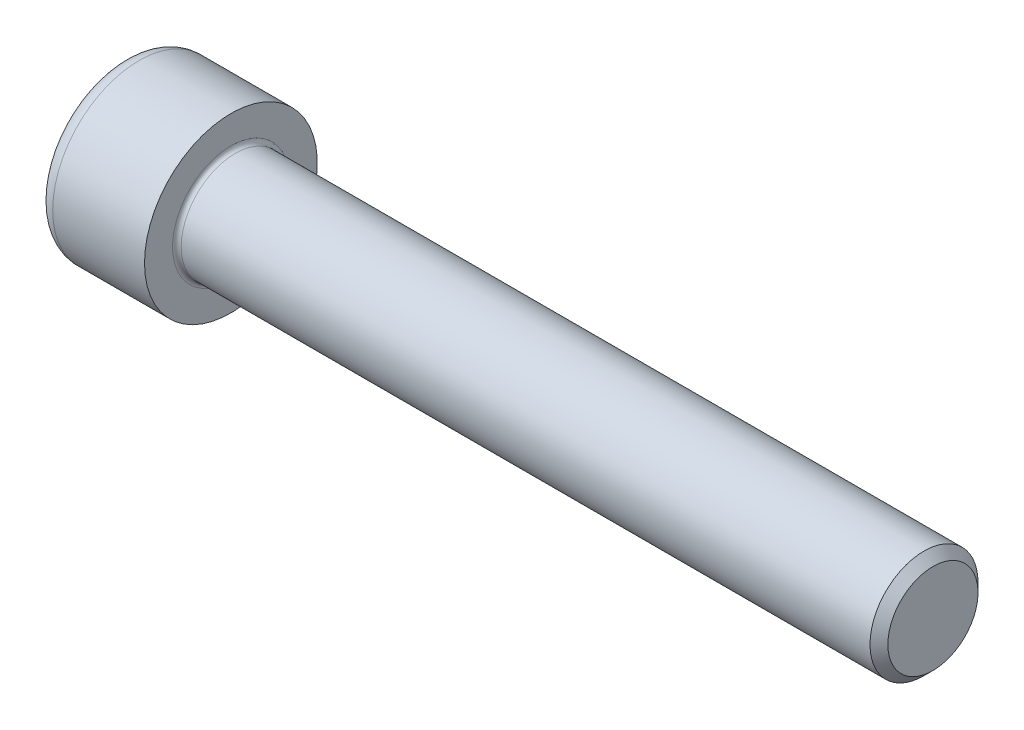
from build123d import *

# Parameters (mm, degrees)
FILLET1_R   = 0.4
FILLET2_R   = 1.5
HEX_2_DEPTH = 5


with BuildPart() as part:
    # BodySke → Base-Revolve (revolve)
    with BuildSketch(Plane.XY, mode=Mode.PRIVATE) as base_revolve_sk:
        Polygon((0, 0), (0, 8), (10, 8), (10, 5), (74.172, 5), (75, 4.172), (75, 0), align=None)
    revolve(base_revolve_sk.sketch.rotate(Axis((-31.75, 0, 0), (1, 0, 0)), 90), axis=Axis((-31.75, 0, 0), (1, 0, 0)))

    # Fillet1
    fillet1_edges = [part.edges().sort_by_distance(p)[0] for p in [
        (10, 0, -5),
    ]]
    fillet(fillet1_edges, radius=FILLET1_R)

    # Fillet2
    fillet2_edges = [part.edges().sort_by_distance(p)[0] for p in [
        (0, 0, -8),
    ]]
    fillet(fillet2_edges, radius=FILLET2_R)

    # Sketch2 → Hex-PreBroach (revolve, cut)
    with BuildSketch(Plane.XY, mode=Mode.PRIVATE) as hex_prebroach_sk:
        Polygon((0, 4.0575), (5, 4.0575), (7.342598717, 0), (0, 0), align=None)
    revolve(hex_prebroach_sk.sketch.rotate(Axis((0, 0, 0), (1, 0, 0)), 90), axis=Axis((0, 0, 0), (1, 0, 0)), mode=Mode.SUBTRACT)

    # Sketch3 → Hex 2 (cut)
    with BuildSketch(Plane(origin=(0, 0, 0), x_dir=(0, 0.500000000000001, 0.866025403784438), z_dir=(-1, 0, 0))):
        Polygon((2.342598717, 4.0575), (-2.342598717, 4.0575), (-4.685197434, 0), (-2.342598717, -4.0575), (2.342598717, -4.0575), (4.685197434, 0), align=None)
    extrude(amount=-HEX_2_DEPTH, mode=Mode.SUBTRACT)


solid = part.part
